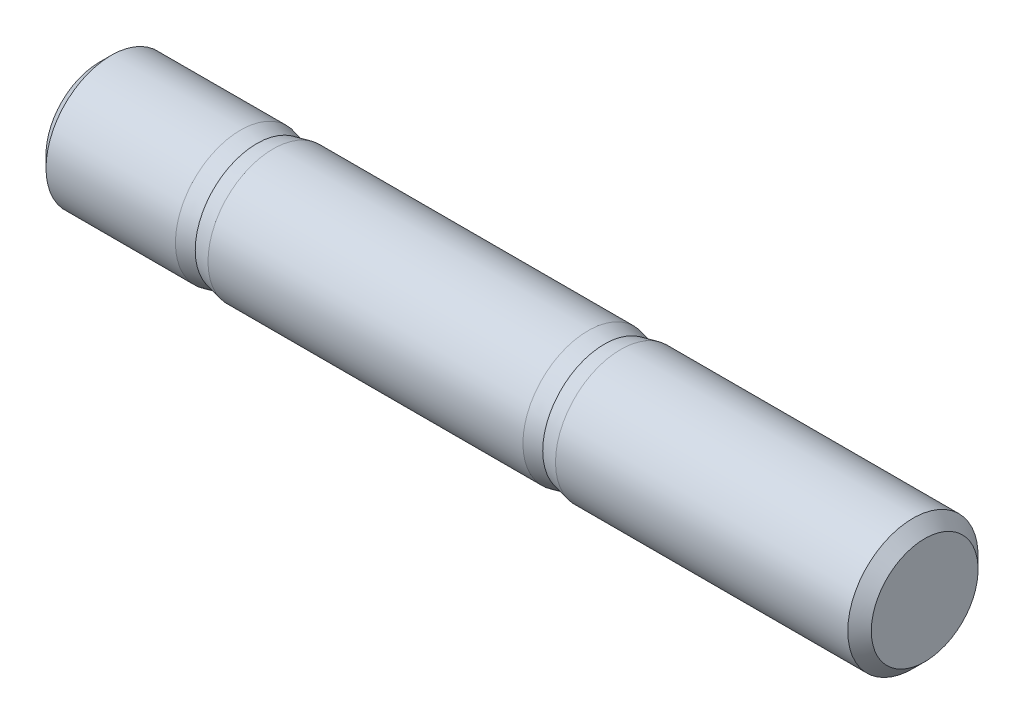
ISO-10303-21;
HEADER;
FILE_DESCRIPTION(('STEP AP214'),'2;1');
FILE_NAME('part.step','',(''),(''),'','','');
FILE_SCHEMA(('AUTOMOTIVE_DESIGN { 1 0 10303 214 1 1 1 1 }'));
ENDSEC;
DATA;
#1=APPLICATION_CONTEXT('core data for automotive mechanical design processes');
#2=APPLICATION_PROTOCOL_DEFINITION('international standard','automotive_design',2000,#1);
#3=PRODUCT_CONTEXT('',#1,'mechanical');
#4=PRODUCT('Part','Part','',(#3));
#5=PRODUCT_RELATED_PRODUCT_CATEGORY('part','',(#4));
#6=PRODUCT_DEFINITION_FORMATION('','',#4);
#7=PRODUCT_DEFINITION_CONTEXT('part definition',#1,'design');
#8=PRODUCT_DEFINITION('design','',#6,#7);
#9=PRODUCT_DEFINITION_SHAPE('','',#8);
#10=(LENGTH_UNIT() NAMED_UNIT(*) SI_UNIT(.MILLI.,.METRE.));
#11=(NAMED_UNIT(*) PLANE_ANGLE_UNIT() SI_UNIT($,.RADIAN.));
#12=(NAMED_UNIT(*) SI_UNIT($,.STERADIAN.) SOLID_ANGLE_UNIT());
#13=UNCERTAINTY_MEASURE_WITH_UNIT(LENGTH_MEASURE(1.E-05),#10,'distance_accuracy_value','');
#14=(GEOMETRIC_REPRESENTATION_CONTEXT(3) GLOBAL_UNCERTAINTY_ASSIGNED_CONTEXT((#13)) GLOBAL_UNIT_ASSIGNED_CONTEXT((#10,
#11,#12)) REPRESENTATION_CONTEXT('',''));
#15=CARTESIAN_POINT('',(0.,0.,0.));
#16=DIRECTION('',(0.,0.,1.));
#17=DIRECTION('',(1.,0.,0.));
#18=AXIS2_PLACEMENT_3D('',#15,#16,#17);
#19=CARTESIAN_POINT('',(8.,0.,0.));
#20=DIRECTION('',(-1.,0.,0.));
#21=DIRECTION('',(0.,0.,1.));
#22=AXIS2_PLACEMENT_3D('',#19,#20,#21);
#23=CONICAL_SURFACE('',#22,2.675,0.213368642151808);
#24=CARTESIAN_POINT('',(6.5,0.,0.));
#25=DIRECTION('',(-1.,0.,0.));
#26=DIRECTION('',(0.,0.,1.));
#27=AXIS2_PLACEMENT_3D('',#24,#25,#26);
#28=CIRCLE('',#27,3.);
#29=CARTESIAN_POINT('',(6.5,0.,3.));
#30=VERTEX_POINT('',#29);
#31=EDGE_CURVE('E58',#30,#30,#28,.T.);
#32=ORIENTED_EDGE('',*,*,#31,.F.);
#33=EDGE_LOOP('',(#32));
#34=FACE_BOUND('',#33,.T.);
#35=CARTESIAN_POINT('',(7.25,0.,0.));
#36=DIRECTION('',(1.,0.,0.));
#37=DIRECTION('',(0.,0.,-1.));
#38=AXIS2_PLACEMENT_3D('',#35,#36,#37);
#39=CIRCLE('',#38,2.8375);
#40=CARTESIAN_POINT('',(7.25,0.,-2.8375));
#41=VERTEX_POINT('',#40);
#42=EDGE_CURVE('E10',#41,#41,#39,.T.);
#43=ORIENTED_EDGE('',*,*,#42,.F.);
#44=EDGE_LOOP('',(#43));
#45=FACE_BOUND('',#44,.T.);
#46=ADVANCED_FACE('F32',(#34,#45),#23,.T.);
#47=CARTESIAN_POINT('',(0.,0.,0.));
#48=DIRECTION('',(1.,0.,0.));
#49=DIRECTION('',(0.,0.,-1.));
#50=AXIS2_PLACEMENT_3D('',#47,#48,#49);
#51=PLANE('',#50);
#52=CARTESIAN_POINT('',(0.,0.,0.));
#53=DIRECTION('',(1.,0.,0.));
#54=DIRECTION('',(0.,0.,-1.));
#55=AXIS2_PLACEMENT_3D('',#52,#53,#54);
#56=CIRCLE('',#55,2.45849999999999);
#57=CARTESIAN_POINT('',(0.,0.,-2.45849999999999));
#58=VERTEX_POINT('',#57);
#59=EDGE_CURVE('E55',#58,#58,#56,.F.);
#60=ORIENTED_EDGE('',*,*,#59,.T.);
#61=EDGE_LOOP('',(#60));
#62=FACE_BOUND('',#61,.T.);
#63=ADVANCED_FACE('F88',(#62),#51,.F.);
#64=CARTESIAN_POINT('',(-1.31084166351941,0.,0.));
#65=DIRECTION('',(-1.,0.,0.));
#66=DIRECTION('',(0.,0.,1.));
#67=AXIS2_PLACEMENT_3D('',#64,#65,#66);
#68=CYLINDRICAL_SURFACE('',#67,3.);
#69=CARTESIAN_POINT('',(0.541500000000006,0.,0.));
#70=DIRECTION('',(1.,0.,0.));
#71=DIRECTION('',(0.,0.,-1.));
#72=AXIS2_PLACEMENT_3D('',#69,#70,#71);
#73=CIRCLE('',#72,3.);
#74=CARTESIAN_POINT('',(0.541500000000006,0.,-3.));
#75=VERTEX_POINT('',#74);
#76=EDGE_CURVE('E52',#75,#75,#73,.T.);
#77=ORIENTED_EDGE('',*,*,#76,.T.);
#78=EDGE_LOOP('',(#77));
#79=FACE_BOUND('',#78,.T.);
#80=ORIENTED_EDGE('',*,*,#31,.T.);
#81=EDGE_LOOP('',(#80));
#82=FACE_BOUND('',#81,.T.);
#83=ADVANCED_FACE('F94',(#79,#82),#68,.T.);
#84=CARTESIAN_POINT('',(0.,0.,0.));
#85=DIRECTION('',(1.,0.,0.));
#86=DIRECTION('',(0.,0.,-1.));
#87=AXIS2_PLACEMENT_3D('',#84,#85,#86);
#88=CONICAL_SURFACE('',#87,2.45849999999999,0.78539816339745);
#89=ORIENTED_EDGE('',*,*,#76,.F.);
#90=EDGE_LOOP('',(#89));
#91=FACE_BOUND('',#90,.T.);
#92=ORIENTED_EDGE('',*,*,#59,.F.);
#93=EDGE_LOOP('',(#92));
#94=FACE_BOUND('',#93,.T.);
#95=ADVANCED_FACE('F84',(#91,#94),#88,.T.);
#96=CARTESIAN_POINT('',(8.,0.,0.));
#97=DIRECTION('',(1.,0.,0.));
#98=DIRECTION('',(0.,0.,-1.));
#99=AXIS2_PLACEMENT_3D('',#96,#97,#98);
#100=CONICAL_SURFACE('',#99,3.,0.213368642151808);
#101=CARTESIAN_POINT('',(8.,0.,0.));
#102=DIRECTION('',(-1.,0.,0.));
#103=DIRECTION('',(0.,0.,1.));
#104=AXIS2_PLACEMENT_3D('',#101,#102,#103);
#105=CIRCLE('',#104,3.);
#106=CARTESIAN_POINT('',(8.,0.,3.));
#107=VERTEX_POINT('',#106);
#108=EDGE_CURVE('E64',#107,#107,#105,.T.);
#109=ORIENTED_EDGE('',*,*,#108,.T.);
#110=EDGE_LOOP('',(#109));
#111=FACE_BOUND('',#110,.T.);
#112=ORIENTED_EDGE('',*,*,#42,.T.);
#113=EDGE_LOOP('',(#112));
#114=FACE_BOUND('',#113,.T.);
#115=ADVANCED_FACE('F75',(#111,#114),#100,.T.);
#116=CARTESIAN_POINT('',(24.,0.,0.));
#117=DIRECTION('',(-1.,0.,0.));
#118=DIRECTION('',(0.,0.,1.));
#119=AXIS2_PLACEMENT_3D('',#116,#117,#118);
#120=CONICAL_SURFACE('',#119,2.675,0.213368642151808);
#121=CARTESIAN_POINT('',(22.5,0.,0.));
#122=DIRECTION('',(-1.,0.,0.));
#123=DIRECTION('',(0.,0.,1.));
#124=AXIS2_PLACEMENT_3D('',#121,#122,#123);
#125=CIRCLE('',#124,3.);
#126=CARTESIAN_POINT('',(22.5,0.,3.));
#127=VERTEX_POINT('',#126);
#128=EDGE_CURVE('E67',#127,#127,#125,.T.);
#129=ORIENTED_EDGE('',*,*,#128,.F.);
#130=EDGE_LOOP('',(#129));
#131=FACE_BOUND('',#130,.T.);
#132=CARTESIAN_POINT('',(23.25,0.,0.));
#133=DIRECTION('',(-1.,0.,0.));
#134=DIRECTION('',(0.,0.,1.));
#135=AXIS2_PLACEMENT_3D('',#132,#133,#134);
#136=CIRCLE('',#135,2.8375);
#137=CARTESIAN_POINT('',(23.25,0.,2.8375));
#138=VERTEX_POINT('',#137);
#139=EDGE_CURVE('E39',#138,#138,#136,.T.);
#140=ORIENTED_EDGE('',*,*,#139,.T.);
#141=EDGE_LOOP('',(#140));
#142=FACE_BOUND('',#141,.T.);
#143=ADVANCED_FACE('F73',(#131,#142),#120,.T.);
#144=CARTESIAN_POINT('',(-1.31084166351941,0.,0.));
#145=DIRECTION('',(-1.,0.,0.));
#146=DIRECTION('',(0.,0.,1.));
#147=AXIS2_PLACEMENT_3D('',#144,#145,#146);
#148=CYLINDRICAL_SURFACE('',#147,3.);
#149=ORIENTED_EDGE('',*,*,#108,.F.);
#150=EDGE_LOOP('',(#149));
#151=FACE_BOUND('',#150,.T.);
#152=ORIENTED_EDGE('',*,*,#128,.T.);
#153=EDGE_LOOP('',(#152));
#154=FACE_BOUND('',#153,.T.);
#155=ADVANCED_FACE('F71',(#151,#154),#148,.T.);
#156=CARTESIAN_POINT('',(38.,3.,0.));
#157=DIRECTION('',(-1.,0.,0.));
#158=DIRECTION('',(0.,0.,1.));
#159=AXIS2_PLACEMENT_3D('',#156,#157,#158);
#160=PLANE('',#159);
#161=CARTESIAN_POINT('',(38.,0.,0.));
#162=DIRECTION('',(-1.,0.,0.));
#163=DIRECTION('',(0.,0.,1.));
#164=AXIS2_PLACEMENT_3D('',#161,#162,#163);
#165=CIRCLE('',#164,2.45849999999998);
#166=CARTESIAN_POINT('',(38.,0.,2.45849999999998));
#167=VERTEX_POINT('',#166);
#168=EDGE_CURVE('E43',#167,#167,#165,.F.);
#169=ORIENTED_EDGE('',*,*,#168,.T.);
#170=EDGE_LOOP('',(#169));
#171=FACE_BOUND('',#170,.T.);
#172=ADVANCED_FACE('F81',(#171),#160,.F.);
#173=CARTESIAN_POINT('',(37.4585,0.,0.));
#174=DIRECTION('',(-1.,0.,0.));
#175=DIRECTION('',(0.,0.,1.));
#176=AXIS2_PLACEMENT_3D('',#173,#174,#175);
#177=CONICAL_SURFACE('',#176,3.,0.785398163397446);
#178=CARTESIAN_POINT('',(37.4585,0.,0.));
#179=DIRECTION('',(-1.,0.,0.));
#180=DIRECTION('',(0.,0.,1.));
#181=AXIS2_PLACEMENT_3D('',#178,#179,#180);
#182=CIRCLE('',#181,3.);
#183=CARTESIAN_POINT('',(37.4585,0.,3.));
#184=VERTEX_POINT('',#183);
#185=EDGE_CURVE('E47',#184,#184,#182,.T.);
#186=CARTESIAN_POINT('',(38.,0.,2.45849999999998));
#187=CARTESIAN_POINT('',(37.994359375,0.,2.46414062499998));
#188=CARTESIAN_POINT('',(37.98871875,0.,2.46978124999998));
#189=CARTESIAN_POINT('',(37.9774375,0.,2.48106249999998));
#190=CARTESIAN_POINT('',(37.971796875,0.,2.48670312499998));
#191=CARTESIAN_POINT('',(37.960515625,0.,2.49798437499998));
#192=CARTESIAN_POINT('',(37.954875,0.,2.50362499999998));
#193=CARTESIAN_POINT('',(37.94359375,0.,2.51490624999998));
#194=CARTESIAN_POINT('',(37.937953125,0.,2.52054687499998));
#195=CARTESIAN_POINT('',(37.926671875,0.,2.53182812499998));
#196=CARTESIAN_POINT('',(37.92103125,0.,2.53746874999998));
#197=CARTESIAN_POINT('',(37.90975,0.,2.54874999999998));
#198=CARTESIAN_POINT('',(37.904109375,0.,2.55439062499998));
#199=CARTESIAN_POINT('',(37.892828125,0.,2.56567187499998));
#200=CARTESIAN_POINT('',(37.8871875,0.,2.57131249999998));
#201=CARTESIAN_POINT('',(37.87590625,0.,2.58259374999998));
#202=CARTESIAN_POINT('',(37.870265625,0.,2.58823437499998));
#203=CARTESIAN_POINT('',(37.858984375,0.,2.59951562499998));
#204=CARTESIAN_POINT('',(37.85334375,0.,2.60515624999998));
#205=CARTESIAN_POINT('',(37.8420625,0.,2.61643749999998));
#206=CARTESIAN_POINT('',(37.836421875,0.,2.62207812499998));
#207=CARTESIAN_POINT('',(37.825140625,0.,2.63335937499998));
#208=CARTESIAN_POINT('',(37.8195,0.,2.63899999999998));
#209=CARTESIAN_POINT('',(37.80821875,0.,2.65028124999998));
#210=CARTESIAN_POINT('',(37.802578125,0.,2.65592187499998));
#211=CARTESIAN_POINT('',(37.791296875,0.,2.66720312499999));
#212=CARTESIAN_POINT('',(37.78565625,0.,2.67284374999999));
#213=CARTESIAN_POINT('',(37.774375,0.,2.68412499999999));
#214=CARTESIAN_POINT('',(37.768734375,0.,2.68976562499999));
#215=CARTESIAN_POINT('',(37.757453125,0.,2.70104687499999));
#216=CARTESIAN_POINT('',(37.7518125,0.,2.70668749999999));
#217=CARTESIAN_POINT('',(37.74053125,0.,2.71796874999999));
#218=CARTESIAN_POINT('',(37.734890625,0.,2.72360937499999));
#219=CARTESIAN_POINT('',(37.723609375,0.,2.73489062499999));
#220=CARTESIAN_POINT('',(37.71796875,0.,2.74053124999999));
#221=CARTESIAN_POINT('',(37.7066875,0.,2.75181249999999));
#222=CARTESIAN_POINT('',(37.701046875,0.,2.75745312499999));
#223=CARTESIAN_POINT('',(37.689765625,0.,2.76873437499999));
#224=CARTESIAN_POINT('',(37.684125,0.,2.77437499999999));
#225=CARTESIAN_POINT('',(37.67284375,0.,2.78565624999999));
#226=CARTESIAN_POINT('',(37.667203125,0.,2.79129687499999));
#227=CARTESIAN_POINT('',(37.655921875,0.,2.80257812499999));
#228=CARTESIAN_POINT('',(37.65028125,0.,2.80821874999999));
#229=CARTESIAN_POINT('',(37.639,0.,2.81949999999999));
#230=CARTESIAN_POINT('',(37.633359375,0.,2.82514062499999));
#231=CARTESIAN_POINT('',(37.622078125,0.,2.83642187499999));
#232=CARTESIAN_POINT('',(37.6164375,0.,2.84206249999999));
#233=CARTESIAN_POINT('',(37.60515625,0.,2.85334374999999));
#234=CARTESIAN_POINT('',(37.599515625,0.,2.85898437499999));
#235=CARTESIAN_POINT('',(37.588234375,0.,2.87026562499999));
#236=CARTESIAN_POINT('',(37.58259375,0.,2.87590624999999));
#237=CARTESIAN_POINT('',(37.5713125,0.,2.88718749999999));
#238=CARTESIAN_POINT('',(37.565671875,0.,2.89282812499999));
#239=CARTESIAN_POINT('',(37.554390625,0.,2.90410937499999));
#240=CARTESIAN_POINT('',(37.54875,0.,2.90974999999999));
#241=CARTESIAN_POINT('',(37.53746875,0.,2.92103124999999));
#242=CARTESIAN_POINT('',(37.531828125,0.,2.92667187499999));
#243=CARTESIAN_POINT('',(37.520546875,0.,2.93795312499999));
#244=CARTESIAN_POINT('',(37.51490625,0.,2.94359374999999));
#245=CARTESIAN_POINT('',(37.503625,0.,2.954875));
#246=CARTESIAN_POINT('',(37.497984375,0.,2.96051562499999));
#247=CARTESIAN_POINT('',(37.486703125,0.,2.971796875));
#248=CARTESIAN_POINT('',(37.4810625,0.,2.9774375));
#249=CARTESIAN_POINT('',(37.46978125,0.,2.98871875));
#250=CARTESIAN_POINT('',(37.464140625,0.,2.994359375));
#251=CARTESIAN_POINT('',(37.4585,0.,3.));
#252=B_SPLINE_CURVE_WITH_KNOTS('',3,(#186,#187,#188,#189,#190,#191,#192,#193,#194,#195,#196,
#197,#198,#199,#200,#201,#202,#203,#204,#205,#206,#207,#208,#209,#210,#211,#212,#213,#214,#215,
#216,#217,#218,#219,#220,#221,#222,#223,#224,#225,#226,#227,#228,#229,#230,#231,#232,#233,#234,
#235,#236,#237,#238,#239,#240,#241,#242,#243,#244,#245,#246,#247,#248,#249,#250,#251),
.UNSPECIFIED.,.F.,.F.,(4,2,2,2,2,2,2,2,2,2,2,2,2,2,2,2,2,2,2,2,2,2,2,2,2,2,2,2,2,2,2,2,4),(0.,
0.0239311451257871,0.0478622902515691,0.071793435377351,0.0957245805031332,0.11965572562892,
0.143586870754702,0.167518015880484,0.191449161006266,0.215380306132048,0.239311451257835,
0.263242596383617,0.287173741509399,0.311104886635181,0.335036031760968,0.35896717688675,
0.382898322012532,0.406829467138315,0.430760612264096,0.454691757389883,0.478622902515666,
0.502554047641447,0.526485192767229,0.550416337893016,0.574347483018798,0.59827862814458,
0.622209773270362,0.646140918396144,0.670072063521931,0.694003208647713,0.717934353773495,
0.741865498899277,0.765796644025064),.UNSPECIFIED.);
#253=EDGE_CURVE('BSEAM34',#167,#184,#252,.T.);
#254=ORIENTED_EDGE('',*,*,#168,.F.);
#255=ORIENTED_EDGE('',*,*,#185,.F.);
#256=ORIENTED_EDGE('',*,*,#253,.T.);
#257=ORIENTED_EDGE('',*,*,#253,.F.);
#258=EDGE_LOOP('',(#254,#256,#255,#257));
#259=FACE_BOUND('',#258,.T.);
#260=ADVANCED_FACE('F34',(#259),#177,.T.);
#261=CARTESIAN_POINT('',(-1.31084166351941,0.,0.));
#262=DIRECTION('',(-1.,0.,0.));
#263=DIRECTION('',(0.,0.,1.));
#264=AXIS2_PLACEMENT_3D('',#261,#262,#263);
#265=CYLINDRICAL_SURFACE('',#264,3.);
#266=ORIENTED_EDGE('',*,*,#185,.T.);
#267=EDGE_LOOP('',(#266));
#268=FACE_BOUND('',#267,.T.);
#269=CARTESIAN_POINT('',(24.,0.,0.));
#270=DIRECTION('',(-1.,0.,0.));
#271=DIRECTION('',(0.,0.,1.));
#272=AXIS2_PLACEMENT_3D('',#269,#270,#271);
#273=CIRCLE('',#272,3.);
#274=CARTESIAN_POINT('',(24.,0.,3.));
#275=VERTEX_POINT('',#274);
#276=EDGE_CURVE('E61',#275,#275,#273,.T.);
#277=ORIENTED_EDGE('',*,*,#276,.F.);
#278=EDGE_LOOP('',(#277));
#279=FACE_BOUND('',#278,.T.);
#280=ADVANCED_FACE('F142',(#268,#279),#265,.T.);
#281=CARTESIAN_POINT('',(24.,0.,0.));
#282=DIRECTION('',(1.,0.,0.));
#283=DIRECTION('',(0.,0.,-1.));
#284=AXIS2_PLACEMENT_3D('',#281,#282,#283);
#285=CONICAL_SURFACE('',#284,3.,0.213368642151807);
#286=ORIENTED_EDGE('',*,*,#276,.T.);
#287=EDGE_LOOP('',(#286));
#288=FACE_BOUND('',#287,.T.);
#289=ORIENTED_EDGE('',*,*,#139,.F.);
#290=EDGE_LOOP('',(#289));
#291=FACE_BOUND('',#290,.T.);
#292=ADVANCED_FACE('F101',(#288,#291),#285,.T.);
#293=CLOSED_SHELL('',(#46,#63,#83,#95,#115,#143,#155,#172,#260,#280,#292));
#294=MANIFOLD_SOLID_BREP('B2',#293);
#295=ADVANCED_BREP_SHAPE_REPRESENTATION('',(#18,#294),#14);
#296=SHAPE_DEFINITION_REPRESENTATION(#9,#295);
ENDSEC;
END-ISO-10303-21;
